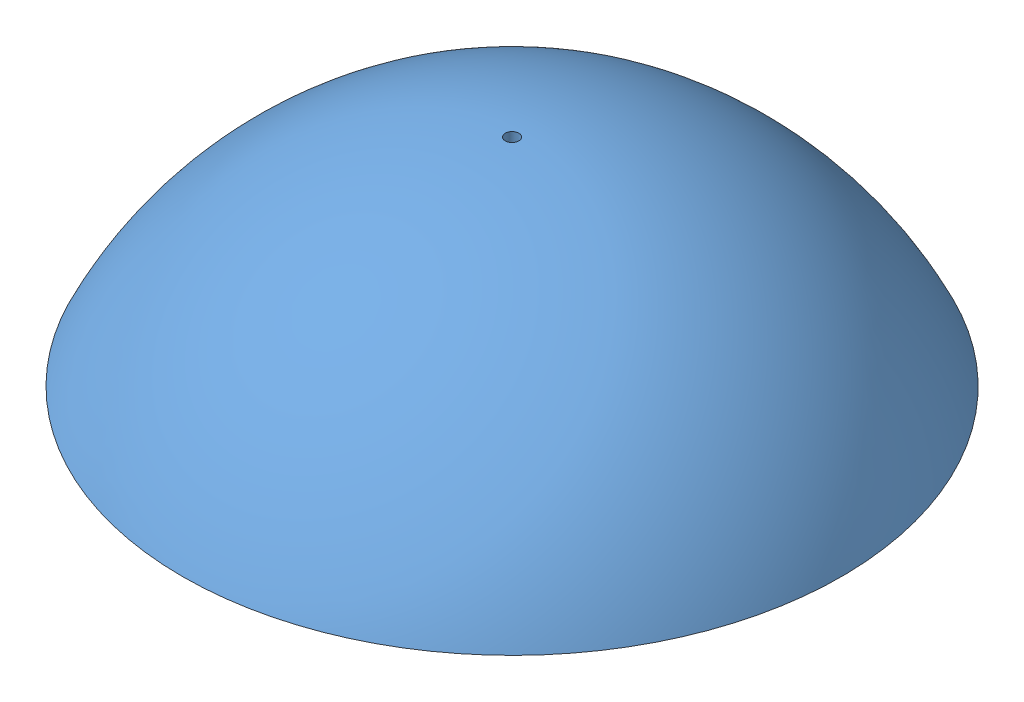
SolidWorks assembly Pop Off Nose Assembly.SLDASM, configuration Default (file format 5000). Lengths in mm.
Overall size (242.97 179.98 242.97).
8 component instances, 8 part files, 16 mates.
Components (placement in the parent):
- Pop Off Nosecone Cap-1: Pop Off Nosecone Cap.SLDPRT [Default] at origin size (242.97 79.57 242.97)
- Pop Off Nosecone Line Spool-1: Pop Off Nosecone Line Spool.SLDPRT [Default] at (0 -8.4961 0) x (0.122984 0 -0.992409) z (0.992409 0 0.122984) size (194.96 61.49 194.96)
- Frangibolt Actuator FC2-16-31SR2-1: Frangibolt Actuator FC2-16-31SR2.SLDPRT [Default] at (0 -26.035 0) x (0 1 0) z (-0.687195 0 -0.726473) size (25.4 37.34 12.7)
- Frangibolt Fastener 1-1: Frangibolt Fastener 1.SLDPRT [Default] at (0 4.1275 0) x (0.800767 0 -0.598976) z (0 -1 0) size (8.04 7.36 111.54)
- .25 inch Spectra layer 1-1: .25 inch Spectra layer 1.SLDPRT [Default] at (4.4363 8.7328 34.6421) x (0.9919 0 -0.127024) z (0.127024 0 0.9919) size (77.67 60.27 77.67)
- .25 inch Spectra layer 2-1: .25 inch Spectra layer 2.SLDPRT [Default] at (-39.3079 26.1953 -17.0905) x (-0.398728 0 0.917069) z (-0.917069 0 -0.398728) size (93.85 70.98 93.85)
- .25 inch Spectra layer 2A-1: .25 inch Spectra layer 2A.SLDPRT [Default] at (-13.9825 26.1953 47.383) x (0.959111 0 0.28303) z (-0.28303 0 0.959111) size (107.18 70.98 107.18)
- Frangibolt Base-1: Frangibolt Base.SLDPRT [Default] at (16.3137 1.5875 0.1966) x (-0.737966 0 0.674837) z (0.674837 0 0.737966) size (25.4 29.21 25.4)
Mates (geometry in assembly coordinates):
- Coincident1: coincident anti-aligned: plane of Pop Off Nosecone Cap-1 through (2.4892 46.5827 0) normal (0 -1 0); plane of Pop Off Nosecone Line Spool-1 through (0 46.5827 0) normal (0 1 0)
- Concentric2: concentric aligned: cylinder of Pop Off Nosecone Line Spool-1 through (0 46.5827 0) axis (0 -1 0) radius 2.4892; cylinder of Frangibolt Actuator FC2-16-31SR2-1 through (0 -0.635 0) axis (0 -1 0) radius 2.159
- Concentric3: concentric aligned: circle of Pop Off Nosecone Cap-1; circle of Pop Off Nosecone Line Spool-1
- Concentric4: concentric aligned: circle of Frangibolt Actuator FC2-16-31SR2-1; cylinder of Frangibolt Fastener 1-1 through (0 -27.6225 0) axis (0 1 0) radius 2.0828
- Coincident5: coincident: cylinder of Pop Off Nosecone Line Spool-1 through (0 -99.8882 0) axis (0 1 0) radius 31.75; point of .25 inch Spectra layer 1-1
- Coincident7: coincident aligned: line of Pop Off Nosecone Line Spool-1 through (0 52.9937 0) axis (0 -1 0); line of .25 inch Spectra layer 1-1 through (0 55.107 0) axis (0 -1 0)
- Coincident8: coincident: plane of Pop Off Nosecone Line Spool-1 through (0 39.689 0) normal (0 -1 0); point of .25 inch Spectra layer 1-1
- Coincident9: coincident: plane of Pop Off Nosecone Line Spool-1 through (0 39.689 0) normal (0 -1 0); point of .25 inch Spectra layer 1-1
- Coincident10: coincident aligned: axis of Pop Off Nosecone Line Spool-1 through (0 59.8791 0) axis (0 -1 0); line of .25 inch Spectra layer 2-1 through (0 72.5695 0) axis (0 -1 0)
- Coincident14: coincident: plane of Pop Off Nosecone Line Spool-1 through (39.4383 33.339 4.8874) normal (0 -1 0); point of .25 inch Spectra layer 2-1
- Coincident15: coincident aligned: axis of Pop Off Nosecone Line Spool-1 through (0 51.9884 0) axis (0 -1 0); line of .25 inch Spectra layer 2A-1 through (0 72.5695 0) axis (0 -1 0)
- Coincident16: coincident: plane of Pop Off Nosecone Line Spool-1 through (39.4383 33.339 4.8874) normal (0 -1 0); point of .25 inch Spectra layer 2A-1
- Coincident20: coincident anti-aligned: plane of Pop Off Nosecone Line Spool-1 through (-119.0994 1.5875 116.2601) normal (0 -1 0); plane of Frangibolt Base-1 through (-2.4307 1.5875 17.3375) normal (0 1 0)
- Concentric7: concentric anti-aligned: cylinder of Frangibolt Fastener 1-1 through (0 -27.6225 0) axis (0 1 0) radius 2.0828; cylinder of Frangibolt Base-1 through (0 1.5875 0) axis (0 -1 0) radius 2.3813
- Coincident21: coincident anti-aligned: plane of Frangibolt Actuator FC2-16-31SR2-1 through (-7.9157 -26.035 9.697) normal (0 -1 0); plane of Frangibolt Base-1 through (-2.4307 -26.035 17.3375) normal (0 1 0)
- Coincident22: coincident anti-aligned: plane of Frangibolt Fastener 1-1 through (2.7473 -27.6225 -2.4276) normal (0 1 0); plane of Frangibolt Base-1 through (-2.4307 -27.6225 17.3375) normal (0 -1 0)
